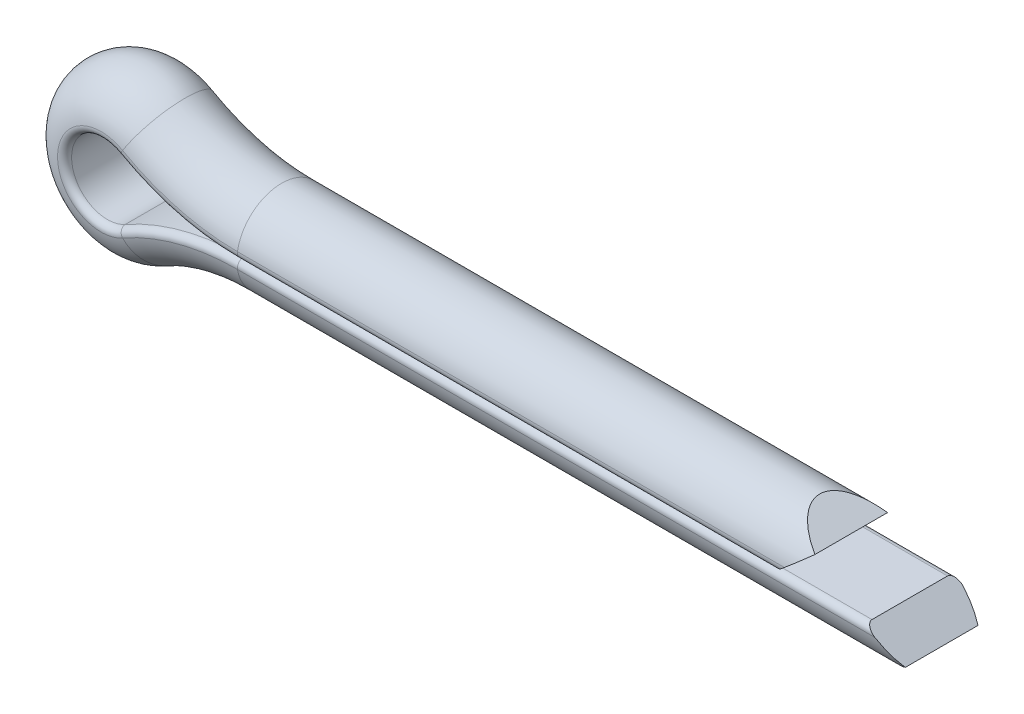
ISO-10303-21;
HEADER;
FILE_DESCRIPTION(('STEP AP214'),'2;1');
FILE_NAME('part.step','',(''),(''),'','','');
FILE_SCHEMA(('AUTOMOTIVE_DESIGN { 1 0 10303 214 1 1 1 1 }'));
ENDSEC;
DATA;
#1=APPLICATION_CONTEXT('core data for automotive mechanical design processes');
#2=APPLICATION_PROTOCOL_DEFINITION('international standard','automotive_design',2000,#1);
#3=PRODUCT_CONTEXT('',#1,'mechanical');
#4=PRODUCT('Part','Part','',(#3));
#5=PRODUCT_RELATED_PRODUCT_CATEGORY('part','',(#4));
#6=PRODUCT_DEFINITION_FORMATION('','',#4);
#7=PRODUCT_DEFINITION_CONTEXT('part definition',#1,'design');
#8=PRODUCT_DEFINITION('design','',#6,#7);
#9=PRODUCT_DEFINITION_SHAPE('','',#8);
#10=(LENGTH_UNIT() NAMED_UNIT(*) SI_UNIT(.MILLI.,.METRE.));
#11=(NAMED_UNIT(*) PLANE_ANGLE_UNIT() SI_UNIT($,.RADIAN.));
#12=(NAMED_UNIT(*) SI_UNIT($,.STERADIAN.) SOLID_ANGLE_UNIT());
#13=UNCERTAINTY_MEASURE_WITH_UNIT(LENGTH_MEASURE(1.E-05),#10,'distance_accuracy_value','');
#14=(GEOMETRIC_REPRESENTATION_CONTEXT(3) GLOBAL_UNCERTAINTY_ASSIGNED_CONTEXT((#13)) GLOBAL_UNIT_ASSIGNED_CONTEXT((#10,
#11,#12)) REPRESENTATION_CONTEXT('',''));
#15=CARTESIAN_POINT('',(0.,0.,0.));
#16=DIRECTION('',(0.,0.,1.));
#17=DIRECTION('',(1.,0.,0.));
#18=AXIS2_PLACEMENT_3D('',#15,#16,#17);
#19=CARTESIAN_POINT('',(4.78536000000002,0.,0.));
#20=DIRECTION('',(1.,0.,0.));
#21=DIRECTION('',(0.,1.,0.));
#22=AXIS2_PLACEMENT_3D('',#19,#20,#21);
#23=CYLINDRICAL_SURFACE('',#22,1.5748);
#24=CARTESIAN_POINT('',(29.5217157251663,0.,0.));
#25=DIRECTION('',(-0.508590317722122,0.86100864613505,0.));
#26=DIRECTION('',(0.86100864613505,0.508590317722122,0.));
#27=AXIS2_PLACEMENT_3D('',#24,#25,#26);
#28=ELLIPSE('',#27,3.09640184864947,1.5748);
#29=CARTESIAN_POINT('',(27.96036,-0.922279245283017,-1.27647798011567));
#30=VERTEX_POINT('',#29);
#31=CARTESIAN_POINT('',(27.96036,-0.922279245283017,1.27647798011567));
#32=VERTEX_POINT('',#31);
#33=EDGE_CURVE('E166',#30,#32,#28,.T.);
#34=ORIENTED_EDGE('',*,*,#33,.T.);
#35=CARTESIAN_POINT('',(26.8387576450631,0.,0.));
#36=DIRECTION('',(-0.635135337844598,-0.772400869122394,0.));
#37=DIRECTION('',(0.772400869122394,-0.635135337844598,0.));
#38=AXIS2_PLACEMENT_3D('',#35,#36,#37);
#39=ELLIPSE('',#38,2.47947154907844,1.5748);
#40=CARTESIAN_POINT('',(27.1668163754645,-0.269758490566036,1.55152357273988));
#41=VERTEX_POINT('',#40);
#42=EDGE_CURVE('E165',#32,#41,#39,.T.);
#43=ORIENTED_EDGE('',*,*,#42,.T.);
#44=DIRECTION('',(1.,0.,0.));
#45=VECTOR('',#44,1.);
#46=CARTESIAN_POINT('',(4.78536000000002,-0.269758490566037,1.55152357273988));
#47=LINE('',#46,#45);
#48=CARTESIAN_POINT('',(4.78536000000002,-0.269758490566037,1.55152357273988));
#49=VERTEX_POINT('',#48);
#50=EDGE_CURVE('E11',#49,#41,#47,.T.);
#51=ORIENTED_EDGE('',*,*,#50,.F.);
#52=CARTESIAN_POINT('',(4.78536000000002,0.,0.));
#53=DIRECTION('',(-1.,0.,0.));
#54=DIRECTION('',(0.,0.,-1.));
#55=AXIS2_PLACEMENT_3D('',#52,#53,#54);
#56=CIRCLE('',#55,1.5748);
#57=CARTESIAN_POINT('',(4.78536000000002,-0.269758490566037,-1.55152357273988));
#58=VERTEX_POINT('',#57);
#59=EDGE_CURVE('E248',#58,#49,#56,.T.);
#60=ORIENTED_EDGE('',*,*,#59,.F.);
#61=DIRECTION('',(1.,0.,0.));
#62=VECTOR('',#61,1.);
#63=CARTESIAN_POINT('',(4.78536000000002,-0.269758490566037,-1.55152357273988));
#64=LINE('',#63,#62);
#65=CARTESIAN_POINT('',(27.1668163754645,-0.269758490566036,-1.55152357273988));
#66=VERTEX_POINT('',#65);
#67=EDGE_CURVE('E40',#58,#66,#64,.T.);
#68=ORIENTED_EDGE('',*,*,#67,.T.);
#69=EDGE_CURVE('E162',#66,#30,#39,.T.);
#70=ORIENTED_EDGE('',*,*,#69,.T.);
#71=EDGE_LOOP('',(#34,#43,#51,#60,#68,#70));
#72=FACE_BOUND('',#71,.T.);
#73=ADVANCED_FACE('F33',(#72),#23,.T.);
#74=CARTESIAN_POINT('',(4.78536000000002,-0.230599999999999,-1.32630240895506));
#75=DIRECTION('',(1.,0.,0.));
#76=DIRECTION('',(0.,1.,0.));
#77=AXIS2_PLACEMENT_3D('',#74,#75,#76);
#78=CYLINDRICAL_SURFACE('',#77,0.2286);
#79=CARTESIAN_POINT('',(27.1191949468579,-0.230599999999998,-1.32630240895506));
#80=DIRECTION('',(-0.635135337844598,-0.772400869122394,0.));
#81=DIRECTION('',(0.772400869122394,-0.635135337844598,0.));
#82=AXIS2_PLACEMENT_3D('',#79,#80,#81);
#83=ELLIPSE('',#82,0.359923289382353,0.2286);
#84=CARTESIAN_POINT('',(26.8411898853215,-0.00199999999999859,-1.32630240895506));
#85=VERTEX_POINT('',#84);
#86=EDGE_CURVE('E160',#85,#66,#83,.T.);
#87=ORIENTED_EDGE('',*,*,#86,.T.);
#88=ORIENTED_EDGE('',*,*,#67,.F.);
#89=CARTESIAN_POINT('',(4.78536000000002,-0.230599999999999,-1.32630240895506));
#90=DIRECTION('',(-1.,0.,0.));
#91=DIRECTION('',(0.,0.,1.));
#92=AXIS2_PLACEMENT_3D('',#89,#90,#91);
#93=CIRCLE('',#92,0.2286);
#94=CARTESIAN_POINT('',(4.78536000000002,-0.00199999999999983,-1.32630240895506));
#95=VERTEX_POINT('',#94);
#96=EDGE_CURVE('E245',#95,#58,#93,.T.);
#97=ORIENTED_EDGE('',*,*,#96,.F.);
#98=DIRECTION('',(1.,0.,0.));
#99=VECTOR('',#98,1.);
#100=CARTESIAN_POINT('',(4.78536000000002,-0.00199999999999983,-1.32630240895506));
#101=LINE('',#100,#99);
#102=EDGE_CURVE('E266',#95,#85,#101,.T.);
#103=ORIENTED_EDGE('',*,*,#102,.T.);
#104=EDGE_LOOP('',(#87,#88,#97,#103));
#105=FACE_BOUND('',#104,.T.);
#106=ADVANCED_FACE('F272',(#105),#78,.T.);
#107=CARTESIAN_POINT('',(4.78536000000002,-0.00199999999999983,1.32630240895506));
#108=DIRECTION('',(0.,-1.,0.));
#109=DIRECTION('',(1.,0.,0.));
#110=AXIS2_PLACEMENT_3D('',#107,#108,#109);
#111=PLANE('',#110);
#112=DIRECTION('',(1.,0.,0.));
#113=VECTOR('',#112,1.);
#114=CARTESIAN_POINT('',(4.78536000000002,-0.00199999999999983,1.32630240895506));
#115=LINE('',#114,#113);
#116=CARTESIAN_POINT('',(4.78536000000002,-0.00199999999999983,1.32630240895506));
#117=VERTEX_POINT('',#116);
#118=CARTESIAN_POINT('',(26.8411898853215,-0.00199999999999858,1.32630240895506));
#119=VERTEX_POINT('',#118);
#120=EDGE_CURVE('E263',#117,#119,#115,.T.);
#121=ORIENTED_EDGE('',*,*,#120,.T.);
#122=DIRECTION('',(0.,0.,-1.));
#123=VECTOR('',#122,1.);
#124=CARTESIAN_POINT('',(26.8411898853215,-0.00199999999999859,1.32630240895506));
#125=LINE('',#124,#123);
#126=EDGE_CURVE('E154',#119,#85,#125,.T.);
#127=ORIENTED_EDGE('',*,*,#126,.T.);
#128=ORIENTED_EDGE('',*,*,#102,.F.);
#129=DIRECTION('',(0.,0.,-1.));
#130=VECTOR('',#129,1.);
#131=CARTESIAN_POINT('',(4.78536000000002,-0.00199999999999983,1.32630240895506));
#132=LINE('',#131,#130);
#133=EDGE_CURVE('E242',#117,#95,#132,.T.);
#134=ORIENTED_EDGE('',*,*,#133,.F.);
#135=EDGE_LOOP('',(#121,#127,#128,#134));
#136=FACE_BOUND('',#135,.T.);
#137=ADVANCED_FACE('F332',(#136),#111,.F.);
#138=CARTESIAN_POINT('',(4.78536000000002,-0.230599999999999,1.32630240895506));
#139=DIRECTION('',(1.,0.,0.));
#140=DIRECTION('',(0.,1.,0.));
#141=AXIS2_PLACEMENT_3D('',#138,#139,#140);
#142=CYLINDRICAL_SURFACE('',#141,0.2286);
#143=CARTESIAN_POINT('',(27.1191949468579,-0.230599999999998,1.32630240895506));
#144=DIRECTION('',(-0.635135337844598,-0.772400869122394,0.));
#145=DIRECTION('',(0.772400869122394,-0.635135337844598,0.));
#146=AXIS2_PLACEMENT_3D('',#143,#144,#145);
#147=ELLIPSE('',#146,0.359923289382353,0.2286);
#148=EDGE_CURVE('E152',#41,#119,#147,.T.);
#149=ORIENTED_EDGE('',*,*,#148,.T.);
#150=ORIENTED_EDGE('',*,*,#120,.F.);
#151=CARTESIAN_POINT('',(4.78536000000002,-0.230599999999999,1.32630240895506));
#152=DIRECTION('',(-1.,0.,0.));
#153=DIRECTION('',(0.,0.,1.));
#154=AXIS2_PLACEMENT_3D('',#151,#152,#153);
#155=CIRCLE('',#154,0.2286);
#156=EDGE_CURVE('E239',#49,#117,#155,.T.);
#157=ORIENTED_EDGE('',*,*,#156,.F.);
#158=ORIENTED_EDGE('',*,*,#50,.T.);
#159=EDGE_LOOP('',(#149,#150,#157,#158));
#160=FACE_BOUND('',#159,.T.);
#161=ADVANCED_FACE('F329',(#160),#142,.T.);
#162=CARTESIAN_POINT('',(4.78536,-8.45840483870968,0.));
#163=DIRECTION('',(0.,0.,-1.));
#164=DIRECTION('',(-1.,0.,0.));
#165=AXIS2_PLACEMENT_3D('',#162,#163,#164);
#166=TOROIDAL_SURFACE('',#165,8.45840483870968,1.5748);
#167=CARTESIAN_POINT('',(0.62035769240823,-1.09651865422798,0.));
#168=DIRECTION('',(-0.870363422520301,-0.492409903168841,0.));
#169=DIRECTION('',(0.,0.,-1.));
#170=AXIS2_PLACEMENT_3D('',#167,#168,#169);
#171=CIRCLE('',#170,1.5748);
#172=CARTESIAN_POINT('',(0.753189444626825,-1.33130657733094,-1.55152357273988));
#173=VERTEX_POINT('',#172);
#174=CARTESIAN_POINT('',(0.753189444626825,-1.33130657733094,1.55152357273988));
#175=VERTEX_POINT('',#174);
#176=EDGE_CURVE('E224',#173,#175,#171,.T.);
#177=ORIENTED_EDGE('',*,*,#176,.F.);
#178=CARTESIAN_POINT('',(4.78536,-8.45840483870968,-1.55152357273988));
#179=DIRECTION('',(0.,0.,-1.));
#180=DIRECTION('',(-1.,0.,0.));
#181=AXIS2_PLACEMENT_3D('',#178,#179,#180);
#182=CIRCLE('',#181,8.18864634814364);
#183=EDGE_CURVE('E257',#173,#58,#182,.T.);
#184=ORIENTED_EDGE('',*,*,#183,.T.);
#185=ORIENTED_EDGE('',*,*,#59,.T.);
#186=CARTESIAN_POINT('',(4.78536,-8.45840483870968,1.55152357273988));
#187=DIRECTION('',(0.,0.,-1.));
#188=DIRECTION('',(-1.,0.,0.));
#189=AXIS2_PLACEMENT_3D('',#186,#187,#188);
#190=CIRCLE('',#189,8.18864634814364);
#191=EDGE_CURVE('E260',#175,#49,#190,.T.);
#192=ORIENTED_EDGE('',*,*,#191,.F.);
#193=EDGE_LOOP('',(#177,#184,#185,#192));
#194=FACE_BOUND('',#193,.T.);
#195=ADVANCED_FACE('F314',(#194),#166,.T.);
#196=CARTESIAN_POINT('',(4.78536,-8.45840483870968,-1.32630240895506));
#197=DIRECTION('',(0.,0.,-1.));
#198=DIRECTION('',(-1.,0.,0.));
#199=AXIS2_PLACEMENT_3D('',#196,#197,#198);
#200=TOROIDAL_SURFACE('',#199,8.22780483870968,0.2286);
#201=CARTESIAN_POINT('',(0.733907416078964,-1.29722445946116,-1.32630240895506));
#202=DIRECTION('',(-0.870363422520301,-0.492409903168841,0.));
#203=DIRECTION('',(0.,0.,1.));
#204=AXIS2_PLACEMENT_3D('',#201,#202,#203);
#205=CIRCLE('',#204,0.2286);
#206=CARTESIAN_POINT('',(0.621342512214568,-1.09825938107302,-1.32630240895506));
#207=VERTEX_POINT('',#206);
#208=EDGE_CURVE('E221',#207,#173,#205,.T.);
#209=ORIENTED_EDGE('',*,*,#208,.F.);
#210=CARTESIAN_POINT('',(4.78536,-8.45840483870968,-1.32630240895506));
#211=DIRECTION('',(0.,0.,-1.));
#212=DIRECTION('',(-1.,0.,0.));
#213=AXIS2_PLACEMENT_3D('',#210,#211,#212);
#214=CIRCLE('',#213,8.45640483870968);
#215=EDGE_CURVE('E254',#207,#95,#214,.T.);
#216=ORIENTED_EDGE('',*,*,#215,.T.);
#217=ORIENTED_EDGE('',*,*,#96,.T.);
#218=ORIENTED_EDGE('',*,*,#183,.F.);
#219=EDGE_LOOP('',(#209,#216,#217,#218));
#220=FACE_BOUND('',#219,.T.);
#221=ADVANCED_FACE('F320',(#220),#200,.T.);
#222=CARTESIAN_POINT('',(4.78536,-8.45840483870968,0.));
#223=DIRECTION('',(0.,0.,-1.));
#224=DIRECTION('',(-1.,0.,0.));
#225=AXIS2_PLACEMENT_3D('',#222,#223,#224);
#226=CYLINDRICAL_SURFACE('',#225,8.45640483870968);
#227=DIRECTION('',(0.,0.,-1.));
#228=VECTOR('',#227,1.);
#229=CARTESIAN_POINT('',(0.621342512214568,-1.09825938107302,1.32630240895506));
#230=LINE('',#229,#228);
#231=CARTESIAN_POINT('',(0.621342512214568,-1.09825938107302,1.32630240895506));
#232=VERTEX_POINT('',#231);
#233=EDGE_CURVE('E218',#232,#207,#230,.T.);
#234=ORIENTED_EDGE('',*,*,#233,.F.);
#235=CARTESIAN_POINT('',(4.78536,-8.45840483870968,1.32630240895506));
#236=DIRECTION('',(0.,0.,-1.));
#237=DIRECTION('',(-1.,0.,0.));
#238=AXIS2_PLACEMENT_3D('',#235,#236,#237);
#239=CIRCLE('',#238,8.45640483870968);
#240=EDGE_CURVE('E251',#232,#117,#239,.T.);
#241=ORIENTED_EDGE('',*,*,#240,.T.);
#242=ORIENTED_EDGE('',*,*,#133,.T.);
#243=ORIENTED_EDGE('',*,*,#215,.F.);
#244=EDGE_LOOP('',(#234,#241,#242,#243));
#245=FACE_BOUND('',#244,.T.);
#246=ADVANCED_FACE('F325',(#245),#226,.T.);
#247=CARTESIAN_POINT('',(4.78536,-8.45840483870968,1.32630240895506));
#248=DIRECTION('',(0.,0.,-1.));
#249=DIRECTION('',(-1.,0.,0.));
#250=AXIS2_PLACEMENT_3D('',#247,#248,#249);
#251=TOROIDAL_SURFACE('',#250,8.22780483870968,0.2286);
#252=CARTESIAN_POINT('',(0.733907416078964,-1.29722445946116,1.32630240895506));
#253=DIRECTION('',(-0.870363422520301,-0.492409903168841,0.));
#254=DIRECTION('',(0.,0.,1.));
#255=AXIS2_PLACEMENT_3D('',#252,#253,#254);
#256=CIRCLE('',#255,0.2286);
#257=EDGE_CURVE('E215',#175,#232,#256,.T.);
#258=ORIENTED_EDGE('',*,*,#257,.F.);
#259=ORIENTED_EDGE('',*,*,#191,.T.);
#260=ORIENTED_EDGE('',*,*,#156,.T.);
#261=ORIENTED_EDGE('',*,*,#240,.F.);
#262=EDGE_LOOP('',(#258,#259,#260,#261));
#263=FACE_BOUND('',#262,.T.);
#264=ADVANCED_FACE('F327',(#263),#251,.T.);
#265=CARTESIAN_POINT('',(0.,0.,0.));
#266=DIRECTION('',(0.,0.,1.));
#267=DIRECTION('',(1.,0.,0.));
#268=AXIS2_PLACEMENT_3D('',#265,#266,#267);
#269=DEGENERATE_TOROIDAL_SURFACE('',#268,1.25984,1.5748,.T.);
#270=CARTESIAN_POINT('',(0.620357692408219,1.09651865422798,0.));
#271=DIRECTION('',(0.870363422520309,-0.492409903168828,0.));
#272=DIRECTION('',(0.,0.,-1.));
#273=AXIS2_PLACEMENT_3D('',#270,#271,#272);
#274=CIRCLE('',#273,1.5748);
#275=CARTESIAN_POINT('',(0.753189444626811,1.33130657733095,-1.55152357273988));
#276=VERTEX_POINT('',#275);
#277=CARTESIAN_POINT('',(0.753189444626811,1.33130657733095,1.55152357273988));
#278=VERTEX_POINT('',#277);
#279=EDGE_CURVE('E200',#276,#278,#274,.T.);
#280=ORIENTED_EDGE('',*,*,#279,.F.);
#281=CARTESIAN_POINT('',(0.,0.,-1.55152357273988));
#282=DIRECTION('',(0.,0.,1.));
#283=DIRECTION('',(1.,0.,0.));
#284=AXIS2_PLACEMENT_3D('',#281,#282,#283);
#285=CIRCLE('',#284,1.52959849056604);
#286=EDGE_CURVE('E233',#276,#173,#285,.T.);
#287=ORIENTED_EDGE('',*,*,#286,.T.);
#288=ORIENTED_EDGE('',*,*,#176,.T.);
#289=CARTESIAN_POINT('',(0.,0.,1.55152357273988));
#290=DIRECTION('',(0.,0.,1.));
#291=DIRECTION('',(1.,0.,0.));
#292=AXIS2_PLACEMENT_3D('',#289,#290,#291);
#293=CIRCLE('',#292,1.52959849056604);
#294=EDGE_CURVE('E236',#278,#175,#293,.T.);
#295=ORIENTED_EDGE('',*,*,#294,.F.);
#296=EDGE_LOOP('',(#280,#287,#288,#295));
#297=FACE_BOUND('',#296,.T.);
#298=ADVANCED_FACE('F311',(#297),#269,.T.);
#299=CARTESIAN_POINT('',(0.,0.,-1.32630240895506));
#300=DIRECTION('',(0.,0.,1.));
#301=DIRECTION('',(1.,0.,0.));
#302=AXIS2_PLACEMENT_3D('',#299,#300,#301);
#303=TOROIDAL_SURFACE('',#302,1.49044,0.2286);
#304=CARTESIAN_POINT('',(0.733907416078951,1.29722445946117,-1.32630240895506));
#305=DIRECTION('',(0.870363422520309,-0.492409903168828,0.));
#306=DIRECTION('',(0.,0.,1.));
#307=AXIS2_PLACEMENT_3D('',#304,#305,#306);
#308=CIRCLE('',#307,0.2286);
#309=CARTESIAN_POINT('',(0.621342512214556,1.09825938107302,-1.32630240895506));
#310=VERTEX_POINT('',#309);
#311=EDGE_CURVE('E197',#310,#276,#308,.T.);
#312=ORIENTED_EDGE('',*,*,#311,.F.);
#313=CARTESIAN_POINT('',(0.,0.,-1.32630240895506));
#314=DIRECTION('',(0.,0.,1.));
#315=DIRECTION('',(1.,0.,0.));
#316=AXIS2_PLACEMENT_3D('',#313,#314,#315);
#317=CIRCLE('',#316,1.26184);
#318=EDGE_CURVE('E230',#310,#207,#317,.T.);
#319=ORIENTED_EDGE('',*,*,#318,.T.);
#320=ORIENTED_EDGE('',*,*,#208,.T.);
#321=ORIENTED_EDGE('',*,*,#286,.F.);
#322=EDGE_LOOP('',(#312,#319,#320,#321));
#323=FACE_BOUND('',#322,.T.);
#324=ADVANCED_FACE('F318',(#323),#303,.T.);
#325=CARTESIAN_POINT('',(0.,0.,0.));
#326=DIRECTION('',(0.,0.,1.));
#327=DIRECTION('',(1.,0.,0.));
#328=AXIS2_PLACEMENT_3D('',#325,#326,#327);
#329=CYLINDRICAL_SURFACE('',#328,1.26184);
#330=DIRECTION('',(0.,0.,-1.));
#331=VECTOR('',#330,1.);
#332=CARTESIAN_POINT('',(0.621342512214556,1.09825938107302,1.32630240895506));
#333=LINE('',#332,#331);
#334=CARTESIAN_POINT('',(0.621342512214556,1.09825938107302,1.32630240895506));
#335=VERTEX_POINT('',#334);
#336=EDGE_CURVE('E194',#335,#310,#333,.T.);
#337=ORIENTED_EDGE('',*,*,#336,.F.);
#338=CARTESIAN_POINT('',(0.,0.,1.32630240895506));
#339=DIRECTION('',(0.,0.,1.));
#340=DIRECTION('',(1.,0.,0.));
#341=AXIS2_PLACEMENT_3D('',#338,#339,#340);
#342=CIRCLE('',#341,1.26184);
#343=EDGE_CURVE('E227',#335,#232,#342,.T.);
#344=ORIENTED_EDGE('',*,*,#343,.T.);
#345=ORIENTED_EDGE('',*,*,#233,.T.);
#346=ORIENTED_EDGE('',*,*,#318,.F.);
#347=EDGE_LOOP('',(#337,#344,#345,#346));
#348=FACE_BOUND('',#347,.T.);
#349=ADVANCED_FACE('F323',(#348),#329,.F.);
#350=CARTESIAN_POINT('',(0.,0.,1.32630240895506));
#351=DIRECTION('',(0.,0.,1.));
#352=DIRECTION('',(1.,0.,0.));
#353=AXIS2_PLACEMENT_3D('',#350,#351,#352);
#354=TOROIDAL_SURFACE('',#353,1.49044,0.2286);
#355=CARTESIAN_POINT('',(0.733907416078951,1.29722445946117,1.32630240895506));
#356=DIRECTION('',(0.870363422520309,-0.492409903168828,0.));
#357=DIRECTION('',(0.,0.,1.));
#358=AXIS2_PLACEMENT_3D('',#355,#356,#357);
#359=CIRCLE('',#358,0.2286);
#360=EDGE_CURVE('E184',#278,#335,#359,.T.);
#361=ORIENTED_EDGE('',*,*,#360,.F.);
#362=ORIENTED_EDGE('',*,*,#294,.T.);
#363=ORIENTED_EDGE('',*,*,#257,.T.);
#364=ORIENTED_EDGE('',*,*,#343,.F.);
#365=EDGE_LOOP('',(#361,#362,#363,#364));
#366=FACE_BOUND('',#365,.T.);
#367=ADVANCED_FACE('F308',(#366),#354,.T.);
#368=CARTESIAN_POINT('',(4.78536,8.45840483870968,0.));
#369=DIRECTION('',(0.,0.,-1.));
#370=DIRECTION('',(-1.,0.,0.));
#371=AXIS2_PLACEMENT_3D('',#368,#369,#370);
#372=TOROIDAL_SURFACE('',#371,8.45840483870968,1.5748);
#373=CARTESIAN_POINT('',(4.78536,0.,0.));
#374=DIRECTION('',(1.,0.,0.));
#375=DIRECTION('',(0.,0.,-1.));
#376=AXIS2_PLACEMENT_3D('',#373,#374,#375);
#377=CIRCLE('',#376,1.5748);
#378=CARTESIAN_POINT('',(4.78536,0.269758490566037,-1.55152357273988));
#379=VERTEX_POINT('',#378);
#380=CARTESIAN_POINT('',(4.78536,0.269758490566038,1.55152357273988));
#381=VERTEX_POINT('',#380);
#382=EDGE_CURVE('E178',#379,#381,#377,.T.);
#383=ORIENTED_EDGE('',*,*,#382,.F.);
#384=CARTESIAN_POINT('',(4.78536,8.45840483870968,-1.55152357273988));
#385=DIRECTION('',(0.,0.,-1.));
#386=DIRECTION('',(-1.,0.,0.));
#387=AXIS2_PLACEMENT_3D('',#384,#385,#386);
#388=CIRCLE('',#387,8.18864634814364);
#389=EDGE_CURVE('E209',#379,#276,#388,.T.);
#390=ORIENTED_EDGE('',*,*,#389,.T.);
#391=ORIENTED_EDGE('',*,*,#279,.T.);
#392=CARTESIAN_POINT('',(4.78536,8.45840483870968,1.55152357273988));
#393=DIRECTION('',(0.,0.,-1.));
#394=DIRECTION('',(-1.,0.,0.));
#395=AXIS2_PLACEMENT_3D('',#392,#393,#394);
#396=CIRCLE('',#395,8.18864634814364);
#397=EDGE_CURVE('E212',#381,#278,#396,.T.);
#398=ORIENTED_EDGE('',*,*,#397,.F.);
#399=EDGE_LOOP('',(#383,#390,#391,#398));
#400=FACE_BOUND('',#399,.T.);
#401=ADVANCED_FACE('F299',(#400),#372,.T.);
#402=CARTESIAN_POINT('',(4.78536,8.45840483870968,-1.32630240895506));
#403=DIRECTION('',(0.,0.,-1.));
#404=DIRECTION('',(-1.,0.,0.));
#405=AXIS2_PLACEMENT_3D('',#402,#403,#404);
#406=TOROIDAL_SURFACE('',#405,8.22780483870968,0.2286);
#407=CARTESIAN_POINT('',(4.78536,0.2306,-1.32630240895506));
#408=DIRECTION('',(1.,0.,0.));
#409=DIRECTION('',(0.,0.,1.));
#410=AXIS2_PLACEMENT_3D('',#407,#408,#409);
#411=CIRCLE('',#410,0.2286);
#412=CARTESIAN_POINT('',(4.78536,0.00200000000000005,-1.32630240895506));
#413=VERTEX_POINT('',#412);
#414=EDGE_CURVE('E175',#413,#379,#411,.T.);
#415=ORIENTED_EDGE('',*,*,#414,.F.);
#416=CARTESIAN_POINT('',(4.78536,8.45840483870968,-1.32630240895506));
#417=DIRECTION('',(0.,0.,-1.));
#418=DIRECTION('',(-1.,0.,0.));
#419=AXIS2_PLACEMENT_3D('',#416,#417,#418);
#420=CIRCLE('',#419,8.45640483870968);
#421=EDGE_CURVE('E206',#413,#310,#420,.T.);
#422=ORIENTED_EDGE('',*,*,#421,.T.);
#423=ORIENTED_EDGE('',*,*,#311,.T.);
#424=ORIENTED_EDGE('',*,*,#389,.F.);
#425=EDGE_LOOP('',(#415,#422,#423,#424));
#426=FACE_BOUND('',#425,.T.);
#427=ADVANCED_FACE('F295',(#426),#406,.T.);
#428=CARTESIAN_POINT('',(4.78536,8.45840483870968,0.));
#429=DIRECTION('',(0.,0.,-1.));
#430=DIRECTION('',(-1.,0.,0.));
#431=AXIS2_PLACEMENT_3D('',#428,#429,#430);
#432=CYLINDRICAL_SURFACE('',#431,8.45640483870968);
#433=DIRECTION('',(0.,0.,-1.));
#434=VECTOR('',#433,1.);
#435=CARTESIAN_POINT('',(4.78536,0.00200000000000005,1.32630240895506));
#436=LINE('',#435,#434);
#437=CARTESIAN_POINT('',(4.78536,0.00200000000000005,1.32630240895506));
#438=VERTEX_POINT('',#437);
#439=EDGE_CURVE('E172',#438,#413,#436,.T.);
#440=ORIENTED_EDGE('',*,*,#439,.F.);
#441=CARTESIAN_POINT('',(4.78536,8.45840483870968,1.32630240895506));
#442=DIRECTION('',(0.,0.,-1.));
#443=DIRECTION('',(-1.,0.,0.));
#444=AXIS2_PLACEMENT_3D('',#441,#442,#443);
#445=CIRCLE('',#444,8.45640483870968);
#446=EDGE_CURVE('E203',#438,#335,#445,.T.);
#447=ORIENTED_EDGE('',*,*,#446,.T.);
#448=ORIENTED_EDGE('',*,*,#336,.T.);
#449=ORIENTED_EDGE('',*,*,#421,.F.);
#450=EDGE_LOOP('',(#440,#447,#448,#449));
#451=FACE_BOUND('',#450,.T.);
#452=ADVANCED_FACE('F291',(#451),#432,.T.);
#453=CARTESIAN_POINT('',(4.78536,8.45840483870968,1.32630240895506));
#454=DIRECTION('',(0.,0.,-1.));
#455=DIRECTION('',(-1.,0.,0.));
#456=AXIS2_PLACEMENT_3D('',#453,#454,#455);
#457=TOROIDAL_SURFACE('',#456,8.22780483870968,0.2286);
#458=CARTESIAN_POINT('',(4.78536,0.2306,1.32630240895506));
#459=DIRECTION('',(1.,0.,0.));
#460=DIRECTION('',(0.,0.,1.));
#461=AXIS2_PLACEMENT_3D('',#458,#459,#460);
#462=CIRCLE('',#461,0.2286);
#463=EDGE_CURVE('E169',#381,#438,#462,.T.);
#464=ORIENTED_EDGE('',*,*,#463,.F.);
#465=ORIENTED_EDGE('',*,*,#397,.T.);
#466=ORIENTED_EDGE('',*,*,#360,.T.);
#467=ORIENTED_EDGE('',*,*,#446,.F.);
#468=EDGE_LOOP('',(#464,#465,#466,#467));
#469=FACE_BOUND('',#468,.T.);
#470=ADVANCED_FACE('F305',(#469),#457,.T.);
#471=CARTESIAN_POINT('',(4.78536,0.2306,1.32630240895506));
#472=DIRECTION('',(1.,0.,0.));
#473=DIRECTION('',(0.,1.,0.));
#474=AXIS2_PLACEMENT_3D('',#471,#472,#473);
#475=CYLINDRICAL_SURFACE('',#474,0.2286);
#476=DIRECTION('',(1.,0.,0.));
#477=VECTOR('',#476,1.);
#478=CARTESIAN_POINT('',(4.78536,0.00200000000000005,1.32630240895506));
#479=LINE('',#478,#477);
#480=CARTESIAN_POINT('',(23.6661898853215,0.00200000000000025,1.32630240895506));
#481=VERTEX_POINT('',#480);
#482=EDGE_CURVE('E181',#438,#481,#479,.T.);
#483=ORIENTED_EDGE('',*,*,#482,.T.);
#484=CARTESIAN_POINT('',(23.9441949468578,0.2306,1.32630240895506));
#485=DIRECTION('',(-0.635135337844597,0.772400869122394,0.));
#486=DIRECTION('',(0.772400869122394,0.635135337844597,0.));
#487=AXIS2_PLACEMENT_3D('',#484,#485,#486);
#488=ELLIPSE('',#487,0.359923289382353,0.2286);
#489=CARTESIAN_POINT('',(23.9918163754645,0.269758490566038,1.55152357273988));
#490=VERTEX_POINT('',#489);
#491=EDGE_CURVE('E47',#490,#481,#488,.F.);
#492=ORIENTED_EDGE('',*,*,#491,.F.);
#493=DIRECTION('',(1.,0.,0.));
#494=VECTOR('',#493,1.);
#495=CARTESIAN_POINT('',(4.78536,0.269758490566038,1.55152357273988));
#496=LINE('',#495,#494);
#497=EDGE_CURVE('E182',#381,#490,#496,.T.);
#498=ORIENTED_EDGE('',*,*,#497,.F.);
#499=ORIENTED_EDGE('',*,*,#463,.T.);
#500=EDGE_LOOP('',(#483,#492,#498,#499));
#501=FACE_BOUND('',#500,.T.);
#502=ADVANCED_FACE('F303',(#501),#475,.T.);
#503=CARTESIAN_POINT('',(4.78536,0.,0.));
#504=DIRECTION('',(1.,0.,0.));
#505=DIRECTION('',(0.,1.,0.));
#506=AXIS2_PLACEMENT_3D('',#503,#504,#505);
#507=CYLINDRICAL_SURFACE('',#506,1.5748);
#508=CARTESIAN_POINT('',(23.6637576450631,0.,0.));
#509=DIRECTION('',(-0.635135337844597,0.772400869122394,0.));
#510=DIRECTION('',(0.772400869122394,0.635135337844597,0.));
#511=AXIS2_PLACEMENT_3D('',#508,#509,#510);
#512=ELLIPSE('',#511,2.47947154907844,1.5748);
#513=CARTESIAN_POINT('',(24.78536,0.922279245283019,1.27647798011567));
#514=VERTEX_POINT('',#513);
#515=EDGE_CURVE('E144',#514,#490,#512,.F.);
#516=ORIENTED_EDGE('',*,*,#515,.F.);
#517=CARTESIAN_POINT('',(26.3467157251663,0.,0.));
#518=DIRECTION('',(-0.50859031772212,-0.861008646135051,0.));
#519=DIRECTION('',(0.861008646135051,-0.50859031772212,0.));
#520=AXIS2_PLACEMENT_3D('',#517,#518,#519);
#521=ELLIPSE('',#520,3.09640184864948,1.5748);
#522=CARTESIAN_POINT('',(24.78536,0.922279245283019,-1.27647798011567));
#523=VERTEX_POINT('',#522);
#524=EDGE_CURVE('E147',#523,#514,#521,.F.);
#525=ORIENTED_EDGE('',*,*,#524,.F.);
#526=CARTESIAN_POINT('',(23.9918163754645,0.269758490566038,-1.55152357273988));
#527=VERTEX_POINT('',#526);
#528=EDGE_CURVE('E132',#527,#523,#512,.F.);
#529=ORIENTED_EDGE('',*,*,#528,.F.);
#530=DIRECTION('',(1.,0.,0.));
#531=VECTOR('',#530,1.);
#532=CARTESIAN_POINT('',(4.78536,0.269758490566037,-1.55152357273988));
#533=LINE('',#532,#531);
#534=EDGE_CURVE('E185',#379,#527,#533,.T.);
#535=ORIENTED_EDGE('',*,*,#534,.F.);
#536=ORIENTED_EDGE('',*,*,#382,.T.);
#537=ORIENTED_EDGE('',*,*,#497,.T.);
#538=EDGE_LOOP('',(#516,#525,#529,#535,#536,#537));
#539=FACE_BOUND('',#538,.T.);
#540=ADVANCED_FACE('F150',(#539),#507,.T.);
#541=CARTESIAN_POINT('',(4.78536,0.2306,-1.32630240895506));
#542=DIRECTION('',(1.,0.,0.));
#543=DIRECTION('',(0.,1.,0.));
#544=AXIS2_PLACEMENT_3D('',#541,#542,#543);
#545=CYLINDRICAL_SURFACE('',#544,0.2286);
#546=ORIENTED_EDGE('',*,*,#534,.T.);
#547=CARTESIAN_POINT('',(23.9441949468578,0.2306,-1.32630240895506));
#548=DIRECTION('',(-0.635135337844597,0.772400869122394,0.));
#549=DIRECTION('',(0.772400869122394,0.635135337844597,0.));
#550=AXIS2_PLACEMENT_3D('',#547,#548,#549);
#551=ELLIPSE('',#550,0.359923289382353,0.2286);
#552=CARTESIAN_POINT('',(23.6661898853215,0.00200000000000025,-1.32630240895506));
#553=VERTEX_POINT('',#552);
#554=EDGE_CURVE('E138',#553,#527,#551,.F.);
#555=ORIENTED_EDGE('',*,*,#554,.F.);
#556=DIRECTION('',(1.,0.,0.));
#557=VECTOR('',#556,1.);
#558=CARTESIAN_POINT('',(4.78536,0.00200000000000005,-1.32630240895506));
#559=LINE('',#558,#557);
#560=EDGE_CURVE('E187',#413,#553,#559,.T.);
#561=ORIENTED_EDGE('',*,*,#560,.F.);
#562=ORIENTED_EDGE('',*,*,#414,.T.);
#563=EDGE_LOOP('',(#546,#555,#561,#562));
#564=FACE_BOUND('',#563,.T.);
#565=ADVANCED_FACE('F287',(#564),#545,.T.);
#566=CARTESIAN_POINT('',(4.78536,0.00200000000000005,1.32630240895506));
#567=DIRECTION('',(0.,-1.,0.));
#568=DIRECTION('',(1.,0.,0.));
#569=AXIS2_PLACEMENT_3D('',#566,#567,#568);
#570=PLANE('',#569);
#571=DIRECTION('',(0.,0.,-1.));
#572=VECTOR('',#571,1.);
#573=CARTESIAN_POINT('',(23.6661898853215,0.00200000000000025,1.32630240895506));
#574=LINE('',#573,#572);
#575=EDGE_CURVE('E279',#481,#553,#574,.T.);
#576=ORIENTED_EDGE('',*,*,#575,.F.);
#577=ORIENTED_EDGE('',*,*,#482,.F.);
#578=ORIENTED_EDGE('',*,*,#439,.T.);
#579=ORIENTED_EDGE('',*,*,#560,.T.);
#580=EDGE_LOOP('',(#576,#577,#578,#579));
#581=FACE_BOUND('',#580,.T.);
#582=ADVANCED_FACE('F288',(#581),#570,.T.);
#583=CARTESIAN_POINT('',(24.78536,0.922279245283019,-1.55490240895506));
#584=DIRECTION('',(-0.635135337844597,0.772400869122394,0.));
#585=DIRECTION('',(-0.772400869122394,-0.635135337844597,0.));
#586=AXIS2_PLACEMENT_3D('',#583,#584,#585);
#587=PLANE('',#586);
#588=ORIENTED_EDGE('',*,*,#515,.T.);
#589=ORIENTED_EDGE('',*,*,#491,.T.);
#590=ORIENTED_EDGE('',*,*,#575,.T.);
#591=ORIENTED_EDGE('',*,*,#554,.T.);
#592=ORIENTED_EDGE('',*,*,#528,.T.);
#593=DIRECTION('',(0.,0.,1.));
#594=VECTOR('',#593,1.);
#595=CARTESIAN_POINT('',(24.78536,0.922279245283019,-1.55490240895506));
#596=LINE('',#595,#594);
#597=EDGE_CURVE('E135',#523,#514,#596,.T.);
#598=ORIENTED_EDGE('',*,*,#597,.T.);
#599=EDGE_LOOP('',(#588,#589,#590,#591,#592,#598));
#600=FACE_BOUND('',#599,.T.);
#601=ADVANCED_FACE('F134',(#600),#587,.F.);
#602=CARTESIAN_POINT('',(23.6637576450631,1.5848,-1.55490240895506));
#603=DIRECTION('',(-0.50859031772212,-0.861008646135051,0.));
#604=DIRECTION('',(0.861008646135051,-0.50859031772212,0.));
#605=AXIS2_PLACEMENT_3D('',#602,#603,#604);
#606=PLANE('',#605);
#607=ORIENTED_EDGE('',*,*,#524,.T.);
#608=ORIENTED_EDGE('',*,*,#597,.F.);
#609=EDGE_LOOP('',(#607,#608));
#610=FACE_BOUND('',#609,.T.);
#611=ADVANCED_FACE('F146',(#610),#606,.F.);
#612=CARTESIAN_POINT('',(27.96036,-0.922279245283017,-1.55490240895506));
#613=DIRECTION('',(-0.508590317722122,0.86100864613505,0.));
#614=DIRECTION('',(-0.86100864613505,-0.508590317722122,0.));
#615=AXIS2_PLACEMENT_3D('',#612,#613,#614);
#616=PLANE('',#615);
#617=DIRECTION('',(0.,0.,1.));
#618=VECTOR('',#617,1.);
#619=CARTESIAN_POINT('',(27.96036,-0.922279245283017,-1.55490240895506));
#620=LINE('',#619,#618);
#621=EDGE_CURVE('E148',#30,#32,#620,.T.);
#622=ORIENTED_EDGE('',*,*,#621,.T.);
#623=ORIENTED_EDGE('',*,*,#33,.F.);
#624=EDGE_LOOP('',(#622,#623));
#625=FACE_BOUND('',#624,.T.);
#626=ADVANCED_FACE('F333',(#625),#616,.F.);
#627=CARTESIAN_POINT('',(26.8387576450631,0.,-1.55490240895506));
#628=DIRECTION('',(-0.635135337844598,-0.772400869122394,0.));
#629=DIRECTION('',(0.772400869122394,-0.635135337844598,0.));
#630=AXIS2_PLACEMENT_3D('',#627,#628,#629);
#631=PLANE('',#630);
#632=ORIENTED_EDGE('',*,*,#621,.F.);
#633=ORIENTED_EDGE('',*,*,#69,.F.);
#634=ORIENTED_EDGE('',*,*,#86,.F.);
#635=ORIENTED_EDGE('',*,*,#126,.F.);
#636=ORIENTED_EDGE('',*,*,#148,.F.);
#637=ORIENTED_EDGE('',*,*,#42,.F.);
#638=EDGE_LOOP('',(#632,#633,#634,#635,#636,#637));
#639=FACE_BOUND('',#638,.T.);
#640=ADVANCED_FACE('F276',(#639),#631,.F.);
#641=CLOSED_SHELL('',(#73,#106,#137,#161,#195,#221,#246,#264,#298,#324,#349,#367,#401,#427,#452,
#470,#502,#540,#565,#582,#601,#611,#626,#640));
#642=MANIFOLD_SOLID_BREP('B2',#641);
#643=ADVANCED_BREP_SHAPE_REPRESENTATION('',(#18,#642),#14);
#644=SHAPE_DEFINITION_REPRESENTATION(#9,#643);
ENDSEC;
END-ISO-10303-21;
